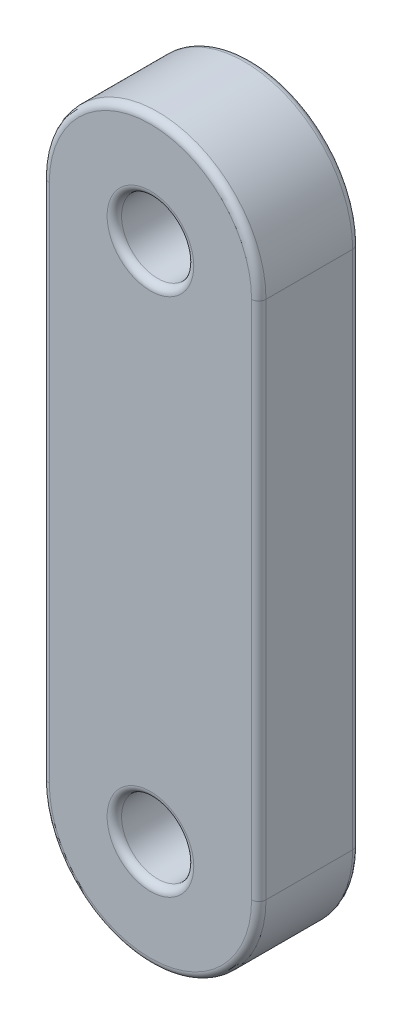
from build123d import *

# Parameters (mm, degrees)
SKETCH_1_R      = 2.5
EXTRUDE_1_DEPTH = 3.5
FILLET_1_R      = 0.5


with BuildPart() as part:
    # Sketch 1 → Extrude 1 (new, symmetric)
    with BuildSketch(Plane.XY):
        with BuildLine():
            Line((-7.5, 18.0025), (-7.5, -18.0025))
            ThreePointArc((-7.5, -18.0025), (0, -25.5025), (7.5, -18.0025))
            Line((7.5, -18.0025), (7.5, 18.0025))
            ThreePointArc((7.5, 18.0025), (0, 25.5025), (-7.5, 18.0025))
        make_face()
        with Locations((0, 18.0025)):
            Circle(SKETCH_1_R, mode=Mode.SUBTRACT)
        with Locations((0, -18.0025)):
            Circle(SKETCH_1_R, mode=Mode.SUBTRACT)
    extrude(amount=EXTRUDE_1_DEPTH, both=True)

    # Fillet 1
    fillet_1_edges = [part.edges().sort_by_distance(p)[0] for p in [
        (0, -25.5025, 3.5),
        (-2.5, 18.0025, -3.5),
        (-2.5, 18.0025, 3.5),
        (7.5, 0, 3.5),
        (-2.5, -18.0025, -3.5),
        (-2.5, -18.0025, 3.5),
        (0, 25.5025, 3.5),
        (7.5, 0, -3.5),
        (0, -25.5025, -3.5),
        (-7.5, 0, -3.5),
        (0, 25.5025, -3.5),
        (-7.5, 0, 3.5),
    ]]
    fillet(fillet_1_edges, radius=FILLET_1_R)


solid = part.part
